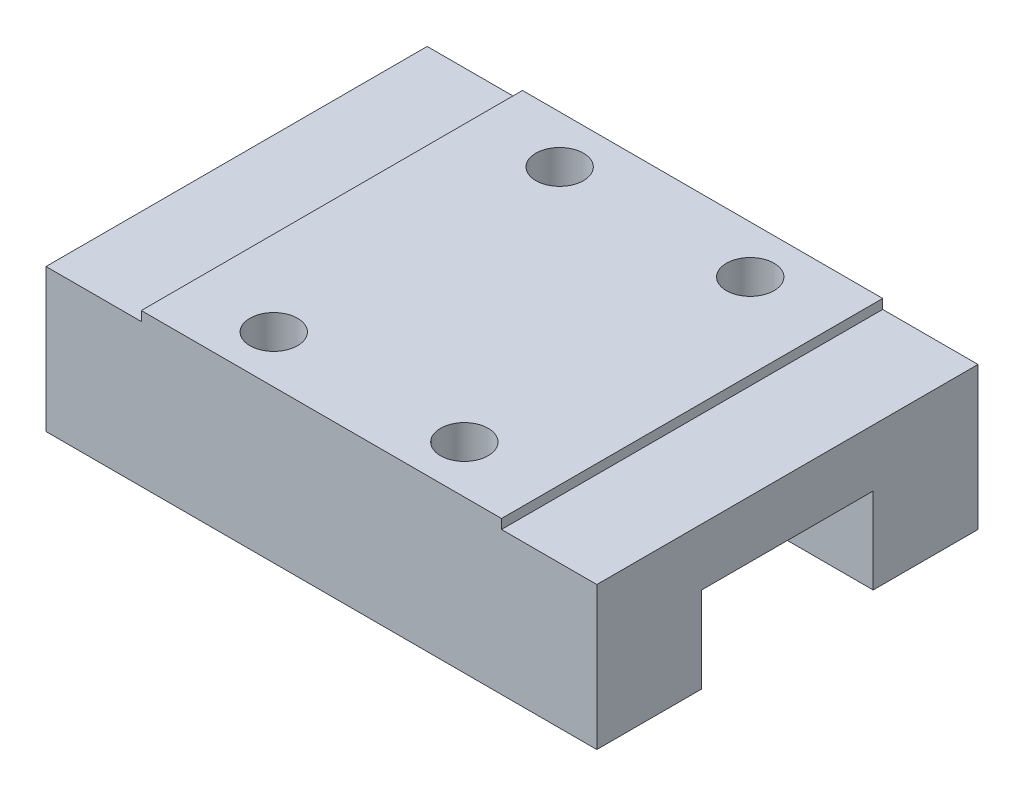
ISO-10303-21;
HEADER;
FILE_DESCRIPTION(('STEP AP214'),'2;1');
FILE_NAME('part.step','',(''),(''),'','','');
FILE_SCHEMA(('AUTOMOTIVE_DESIGN { 1 0 10303 214 1 1 1 1 }'));
ENDSEC;
DATA;
#1=APPLICATION_CONTEXT('core data for automotive mechanical design processes');
#2=APPLICATION_PROTOCOL_DEFINITION('international standard','automotive_design',2000,#1);
#3=PRODUCT_CONTEXT('',#1,'mechanical');
#4=PRODUCT('Part','Part','',(#3));
#5=PRODUCT_RELATED_PRODUCT_CATEGORY('part','',(#4));
#6=PRODUCT_DEFINITION_FORMATION('','',#4);
#7=PRODUCT_DEFINITION_CONTEXT('part definition',#1,'design');
#8=PRODUCT_DEFINITION('design','',#6,#7);
#9=PRODUCT_DEFINITION_SHAPE('','',#8);
#10=(LENGTH_UNIT() NAMED_UNIT(*) SI_UNIT(.MILLI.,.METRE.));
#11=(NAMED_UNIT(*) PLANE_ANGLE_UNIT() SI_UNIT($,.RADIAN.));
#12=(NAMED_UNIT(*) SI_UNIT($,.STERADIAN.) SOLID_ANGLE_UNIT());
#13=UNCERTAINTY_MEASURE_WITH_UNIT(LENGTH_MEASURE(1.E-05),#10,'distance_accuracy_value','');
#14=(GEOMETRIC_REPRESENTATION_CONTEXT(3) GLOBAL_UNCERTAINTY_ASSIGNED_CONTEXT((#13)) GLOBAL_UNIT_ASSIGNED_CONTEXT((#10,
#11,#12)) REPRESENTATION_CONTEXT('',''));
#15=CARTESIAN_POINT('',(0.,0.,0.));
#16=DIRECTION('',(0.,0.,1.));
#17=DIRECTION('',(1.,0.,0.));
#18=AXIS2_PLACEMENT_3D('',#15,#16,#17);
#19=CARTESIAN_POINT('',(0.,0.,20.));
#20=DIRECTION('',(0.,1.,0.));
#21=DIRECTION('',(0.,0.,1.));
#22=AXIS2_PLACEMENT_3D('',#19,#20,#21);
#23=PLANE('',#22);
#24=CARTESIAN_POINT('',(19.4500000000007,0.,17.4999999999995));
#25=DIRECTION('',(0.,1.,0.));
#26=DIRECTION('',(0.,0.,1.));
#27=AXIS2_PLACEMENT_3D('',#24,#25,#26);
#28=CIRCLE('',#27,1.25000000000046);
#29=CARTESIAN_POINT('',(19.4500000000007,0.,18.75));
#30=VERTEX_POINT('',#29);
#31=EDGE_CURVE('E295',#30,#30,#28,.T.);
#32=ORIENTED_EDGE('',*,*,#31,.T.);
#33=EDGE_LOOP('',(#32));
#34=FACE_BOUND('',#33,.T.);
#35=CARTESIAN_POINT('',(9.44999999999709,0.,17.5));
#36=DIRECTION('',(0.,1.,0.));
#37=DIRECTION('',(0.,0.,1.));
#38=AXIS2_PLACEMENT_3D('',#35,#36,#37);
#39=CIRCLE('',#38,1.25);
#40=CARTESIAN_POINT('',(9.44999999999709,0.,18.75));
#41=VERTEX_POINT('',#40);
#42=EDGE_CURVE('E186',#41,#41,#39,.T.);
#43=ORIENTED_EDGE('',*,*,#42,.T.);
#44=EDGE_LOOP('',(#43));
#45=FACE_BOUND('',#44,.T.);
#46=DIRECTION('',(0.,0.,-1.));
#47=VECTOR('',#46,1.);
#48=CARTESIAN_POINT('',(0.,0.,20.));
#49=LINE('',#48,#47);
#50=CARTESIAN_POINT('',(0.,0.,20.));
#51=VERTEX_POINT('',#50);
#52=CARTESIAN_POINT('',(0.,0.,14.5));
#53=VERTEX_POINT('',#52);
#54=EDGE_CURVE('E165',#51,#53,#49,.T.);
#55=ORIENTED_EDGE('',*,*,#54,.T.);
#56=DIRECTION('',(1.,0.,0.));
#57=VECTOR('',#56,1.);
#58=CARTESIAN_POINT('',(0.,0.,14.5));
#59=LINE('',#58,#57);
#60=CARTESIAN_POINT('',(28.9000000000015,0.,14.5));
#61=VERTEX_POINT('',#60);
#62=EDGE_CURVE('E131',#53,#61,#59,.T.);
#63=ORIENTED_EDGE('',*,*,#62,.T.);
#64=DIRECTION('',(0.,0.,-1.));
#65=VECTOR('',#64,1.);
#66=CARTESIAN_POINT('',(28.9000000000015,0.,20.));
#67=LINE('',#66,#65);
#68=CARTESIAN_POINT('',(28.9000000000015,0.,20.));
#69=VERTEX_POINT('',#68);
#70=EDGE_CURVE('E128',#69,#61,#67,.T.);
#71=ORIENTED_EDGE('',*,*,#70,.F.);
#72=DIRECTION('',(1.,0.,0.));
#73=VECTOR('',#72,1.);
#74=CARTESIAN_POINT('',(0.,0.,20.));
#75=LINE('',#74,#73);
#76=EDGE_CURVE('E114',#51,#69,#75,.T.);
#77=ORIENTED_EDGE('',*,*,#76,.F.);
#78=EDGE_LOOP('',(#55,#63,#71,#77));
#79=FACE_BOUND('',#78,.T.);
#80=ADVANCED_FACE('F32',(#34,#45,#79),#23,.F.);
#81=CARTESIAN_POINT('',(23.9000000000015,7.5,20.));
#82=DIRECTION('',(-1.,0.,0.));
#83=DIRECTION('',(0.,0.,1.));
#84=AXIS2_PLACEMENT_3D('',#81,#82,#83);
#85=PLANE('',#84);
#86=DIRECTION('',(0.,1.,0.));
#87=VECTOR('',#86,1.);
#88=CARTESIAN_POINT('',(23.9000000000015,7.5,0.));
#89=LINE('',#88,#87);
#90=CARTESIAN_POINT('',(23.9000000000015,7.5,0.));
#91=VERTEX_POINT('',#90);
#92=CARTESIAN_POINT('',(23.9000000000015,8.,0.));
#93=VERTEX_POINT('',#92);
#94=EDGE_CURVE('E144',#91,#93,#89,.T.);
#95=ORIENTED_EDGE('',*,*,#94,.T.);
#96=DIRECTION('',(0.,0.,-1.));
#97=VECTOR('',#96,1.);
#98=CARTESIAN_POINT('',(23.9000000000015,8.,20.));
#99=LINE('',#98,#97);
#100=CARTESIAN_POINT('',(23.9000000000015,8.,20.));
#101=VERTEX_POINT('',#100);
#102=EDGE_CURVE('E41',#101,#93,#99,.T.);
#103=ORIENTED_EDGE('',*,*,#102,.F.);
#104=DIRECTION('',(0.,1.,0.));
#105=VECTOR('',#104,1.);
#106=CARTESIAN_POINT('',(23.9000000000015,7.5,20.));
#107=LINE('',#106,#105);
#108=CARTESIAN_POINT('',(23.9000000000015,7.5,20.));
#109=VERTEX_POINT('',#108);
#110=EDGE_CURVE('E162',#109,#101,#107,.T.);
#111=ORIENTED_EDGE('',*,*,#110,.F.);
#112=DIRECTION('',(0.,0.,-1.));
#113=VECTOR('',#112,1.);
#114=CARTESIAN_POINT('',(23.9000000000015,7.5,20.));
#115=LINE('',#114,#113);
#116=EDGE_CURVE('E140',#109,#91,#115,.T.);
#117=ORIENTED_EDGE('',*,*,#116,.T.);
#118=EDGE_LOOP('',(#95,#103,#111,#117));
#119=FACE_BOUND('',#118,.T.);
#120=ADVANCED_FACE('F34',(#119),#85,.F.);
#121=CARTESIAN_POINT('',(5.,8.,20.));
#122=DIRECTION('',(0.,-1.,0.));
#123=DIRECTION('',(0.,0.,-1.));
#124=AXIS2_PLACEMENT_3D('',#121,#122,#123);
#125=PLANE('',#124);
#126=CARTESIAN_POINT('',(19.4500000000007,8.,2.49999999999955));
#127=DIRECTION('',(0.,1.,0.));
#128=DIRECTION('',(0.,0.,1.));
#129=AXIS2_PLACEMENT_3D('',#126,#127,#128);
#130=CIRCLE('',#129,1.25000000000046);
#131=CARTESIAN_POINT('',(19.4500000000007,8.,3.75));
#132=VERTEX_POINT('',#131);
#133=EDGE_CURVE('E293',#132,#132,#130,.T.);
#134=ORIENTED_EDGE('',*,*,#133,.F.);
#135=EDGE_LOOP('',(#134));
#136=FACE_BOUND('',#135,.T.);
#137=CARTESIAN_POINT('',(19.4500000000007,8.,17.4999999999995));
#138=DIRECTION('',(0.,1.,0.));
#139=DIRECTION('',(0.,0.,1.));
#140=AXIS2_PLACEMENT_3D('',#137,#138,#139);
#141=CIRCLE('',#140,1.25000000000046);
#142=CARTESIAN_POINT('',(19.4500000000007,8.,18.75));
#143=VERTEX_POINT('',#142);
#144=EDGE_CURVE('E292',#143,#143,#141,.T.);
#145=ORIENTED_EDGE('',*,*,#144,.F.);
#146=EDGE_LOOP('',(#145));
#147=FACE_BOUND('',#146,.T.);
#148=CARTESIAN_POINT('',(9.44999999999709,8.,17.5));
#149=DIRECTION('',(0.,1.,0.));
#150=DIRECTION('',(0.,0.,1.));
#151=AXIS2_PLACEMENT_3D('',#148,#149,#150);
#152=CIRCLE('',#151,1.25);
#153=CARTESIAN_POINT('',(9.44999999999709,8.,18.75));
#154=VERTEX_POINT('',#153);
#155=EDGE_CURVE('E191',#154,#154,#152,.T.);
#156=ORIENTED_EDGE('',*,*,#155,.F.);
#157=EDGE_LOOP('',(#156));
#158=FACE_BOUND('',#157,.T.);
#159=CARTESIAN_POINT('',(9.45000000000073,8.,2.5));
#160=DIRECTION('',(0.,1.,0.));
#161=DIRECTION('',(0.,0.,1.));
#162=AXIS2_PLACEMENT_3D('',#159,#160,#161);
#163=CIRCLE('',#162,1.25);
#164=CARTESIAN_POINT('',(9.45000000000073,8.,3.75));
#165=VERTEX_POINT('',#164);
#166=EDGE_CURVE('E179',#165,#165,#163,.T.);
#167=ORIENTED_EDGE('',*,*,#166,.F.);
#168=EDGE_LOOP('',(#167));
#169=FACE_BOUND('',#168,.T.);
#170=DIRECTION('',(-1.,0.,0.));
#171=VECTOR('',#170,1.);
#172=CARTESIAN_POINT('',(5.,8.,0.));
#173=LINE('',#172,#171);
#174=CARTESIAN_POINT('',(5.,8.,0.));
#175=VERTEX_POINT('',#174);
#176=EDGE_CURVE('E147',#93,#175,#173,.T.);
#177=ORIENTED_EDGE('',*,*,#176,.T.);
#178=DIRECTION('',(0.,0.,-1.));
#179=VECTOR('',#178,1.);
#180=CARTESIAN_POINT('',(5.,8.,20.));
#181=LINE('',#180,#179);
#182=CARTESIAN_POINT('',(5.,8.,20.));
#183=VERTEX_POINT('',#182);
#184=EDGE_CURVE('E173',#183,#175,#181,.T.);
#185=ORIENTED_EDGE('',*,*,#184,.F.);
#186=DIRECTION('',(-1.,0.,0.));
#187=VECTOR('',#186,1.);
#188=CARTESIAN_POINT('',(5.,8.,20.));
#189=LINE('',#188,#187);
#190=EDGE_CURVE('E99',#101,#183,#189,.T.);
#191=ORIENTED_EDGE('',*,*,#190,.F.);
#192=ORIENTED_EDGE('',*,*,#102,.T.);
#193=EDGE_LOOP('',(#177,#185,#191,#192));
#194=FACE_BOUND('',#193,.T.);
#195=ADVANCED_FACE('F262',(#136,#147,#158,#169,#194),#125,.F.);
#196=CARTESIAN_POINT('',(5.,7.5,20.));
#197=DIRECTION('',(1.,0.,0.));
#198=DIRECTION('',(0.,0.,-1.));
#199=AXIS2_PLACEMENT_3D('',#196,#197,#198);
#200=PLANE('',#199);
#201=DIRECTION('',(0.,-1.,0.));
#202=VECTOR('',#201,1.);
#203=CARTESIAN_POINT('',(5.,7.5,0.));
#204=LINE('',#203,#202);
#205=CARTESIAN_POINT('',(5.,7.5,0.));
#206=VERTEX_POINT('',#205);
#207=EDGE_CURVE('E149',#175,#206,#204,.T.);
#208=ORIENTED_EDGE('',*,*,#207,.T.);
#209=DIRECTION('',(0.,0.,-1.));
#210=VECTOR('',#209,1.);
#211=CARTESIAN_POINT('',(5.,7.5,20.));
#212=LINE('',#211,#210);
#213=CARTESIAN_POINT('',(5.,7.5,20.));
#214=VERTEX_POINT('',#213);
#215=EDGE_CURVE('E170',#214,#206,#212,.T.);
#216=ORIENTED_EDGE('',*,*,#215,.F.);
#217=DIRECTION('',(0.,-1.,0.));
#218=VECTOR('',#217,1.);
#219=CARTESIAN_POINT('',(5.,7.5,20.));
#220=LINE('',#219,#218);
#221=EDGE_CURVE('E216',#183,#214,#220,.T.);
#222=ORIENTED_EDGE('',*,*,#221,.F.);
#223=ORIENTED_EDGE('',*,*,#184,.T.);
#224=EDGE_LOOP('',(#208,#216,#222,#223));
#225=FACE_BOUND('',#224,.T.);
#226=ADVANCED_FACE('F264',(#225),#200,.F.);
#227=CARTESIAN_POINT('',(0.,7.5,20.));
#228=DIRECTION('',(0.,-1.,0.));
#229=DIRECTION('',(0.,0.,-1.));
#230=AXIS2_PLACEMENT_3D('',#227,#228,#229);
#231=PLANE('',#230);
#232=DIRECTION('',(-1.,0.,0.));
#233=VECTOR('',#232,1.);
#234=CARTESIAN_POINT('',(0.,7.5,0.));
#235=LINE('',#234,#233);
#236=CARTESIAN_POINT('',(0.,7.5,0.));
#237=VERTEX_POINT('',#236);
#238=EDGE_CURVE('E151',#206,#237,#235,.T.);
#239=ORIENTED_EDGE('',*,*,#238,.T.);
#240=DIRECTION('',(0.,0.,-1.));
#241=VECTOR('',#240,1.);
#242=CARTESIAN_POINT('',(0.,7.5,20.));
#243=LINE('',#242,#241);
#244=CARTESIAN_POINT('',(0.,7.5,20.));
#245=VERTEX_POINT('',#244);
#246=EDGE_CURVE('E167',#245,#237,#243,.T.);
#247=ORIENTED_EDGE('',*,*,#246,.F.);
#248=DIRECTION('',(-1.,0.,0.));
#249=VECTOR('',#248,1.);
#250=CARTESIAN_POINT('',(0.,7.5,20.));
#251=LINE('',#250,#249);
#252=EDGE_CURVE('E218',#214,#245,#251,.T.);
#253=ORIENTED_EDGE('',*,*,#252,.F.);
#254=ORIENTED_EDGE('',*,*,#215,.T.);
#255=EDGE_LOOP('',(#239,#247,#253,#254));
#256=FACE_BOUND('',#255,.T.);
#257=ADVANCED_FACE('F224',(#256),#231,.F.);
#258=CARTESIAN_POINT('',(0.,0.,20.));
#259=DIRECTION('',(1.,0.,0.));
#260=DIRECTION('',(0.,0.,-1.));
#261=AXIS2_PLACEMENT_3D('',#258,#259,#260);
#262=PLANE('',#261);
#263=DIRECTION('',(0.,0.,1.));
#264=VECTOR('',#263,1.);
#265=CARTESIAN_POINT('',(0.,4.5,14.5));
#266=LINE('',#265,#264);
#267=CARTESIAN_POINT('',(0.,4.5,5.5));
#268=VERTEX_POINT('',#267);
#269=CARTESIAN_POINT('',(0.,4.5,14.5));
#270=VERTEX_POINT('',#269);
#271=EDGE_CURVE('E198',#268,#270,#266,.T.);
#272=ORIENTED_EDGE('',*,*,#271,.T.);
#273=DIRECTION('',(0.,-1.,0.));
#274=VECTOR('',#273,1.);
#275=CARTESIAN_POINT('',(0.,-2.,14.5));
#276=LINE('',#275,#274);
#277=EDGE_CURVE('E201',#270,#53,#276,.T.);
#278=ORIENTED_EDGE('',*,*,#277,.T.);
#279=ORIENTED_EDGE('',*,*,#54,.F.);
#280=DIRECTION('',(0.,-1.,0.));
#281=VECTOR('',#280,1.);
#282=CARTESIAN_POINT('',(0.,0.,20.));
#283=LINE('',#282,#281);
#284=EDGE_CURVE('E121',#245,#51,#283,.T.);
#285=ORIENTED_EDGE('',*,*,#284,.F.);
#286=ORIENTED_EDGE('',*,*,#246,.T.);
#287=DIRECTION('',(0.,-1.,0.));
#288=VECTOR('',#287,1.);
#289=CARTESIAN_POINT('',(0.,0.,0.));
#290=LINE('',#289,#288);
#291=CARTESIAN_POINT('',(0.,0.,0.));
#292=VERTEX_POINT('',#291);
#293=EDGE_CURVE('E153',#237,#292,#290,.T.);
#294=ORIENTED_EDGE('',*,*,#293,.T.);
#295=CARTESIAN_POINT('',(0.,0.,5.5));
#296=VERTEX_POINT('',#295);
#297=EDGE_CURVE('E134',#296,#292,#49,.T.);
#298=ORIENTED_EDGE('',*,*,#297,.F.);
#299=DIRECTION('',(0.,1.,0.));
#300=VECTOR('',#299,1.);
#301=CARTESIAN_POINT('',(0.,-2.,5.5));
#302=LINE('',#301,#300);
#303=EDGE_CURVE('E195',#296,#268,#302,.T.);
#304=ORIENTED_EDGE('',*,*,#303,.T.);
#305=EDGE_LOOP('',(#272,#278,#279,#285,#286,#294,#298,#304));
#306=FACE_BOUND('',#305,.T.);
#307=ADVANCED_FACE('F228',(#306),#262,.F.);
#308=CARTESIAN_POINT('',(19.4500000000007,0.,2.49999999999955));
#309=DIRECTION('',(0.,1.,0.));
#310=DIRECTION('',(0.,0.,1.));
#311=AXIS2_PLACEMENT_3D('',#308,#309,#310);
#312=CIRCLE('',#311,1.25000000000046);
#313=CARTESIAN_POINT('',(19.4500000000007,0.,3.75));
#314=VERTEX_POINT('',#313);
#315=EDGE_CURVE('E36',#314,#314,#312,.T.);
#316=ORIENTED_EDGE('',*,*,#315,.T.);
#317=EDGE_LOOP('',(#316));
#318=FACE_BOUND('',#317,.T.);
#319=CARTESIAN_POINT('',(9.45000000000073,0.,2.5));
#320=DIRECTION('',(0.,1.,0.));
#321=DIRECTION('',(0.,0.,1.));
#322=AXIS2_PLACEMENT_3D('',#319,#320,#321);
#323=CIRCLE('',#322,1.25);
#324=CARTESIAN_POINT('',(9.45000000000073,0.,3.75));
#325=VERTEX_POINT('',#324);
#326=EDGE_CURVE('E176',#325,#325,#323,.T.);
#327=ORIENTED_EDGE('',*,*,#326,.T.);
#328=EDGE_LOOP('',(#327));
#329=FACE_BOUND('',#328,.T.);
#330=CARTESIAN_POINT('',(28.9000000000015,0.,5.5));
#331=VERTEX_POINT('',#330);
#332=CARTESIAN_POINT('',(28.9000000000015,0.,0.));
#333=VERTEX_POINT('',#332);
#334=EDGE_CURVE('E135',#331,#333,#67,.T.);
#335=ORIENTED_EDGE('',*,*,#334,.F.);
#336=DIRECTION('',(-1.,0.,0.));
#337=VECTOR('',#336,1.);
#338=CARTESIAN_POINT('',(0.,0.,5.5));
#339=LINE('',#338,#337);
#340=EDGE_CURVE('E49',#331,#296,#339,.T.);
#341=ORIENTED_EDGE('',*,*,#340,.T.);
#342=ORIENTED_EDGE('',*,*,#297,.T.);
#343=DIRECTION('',(1.,0.,0.));
#344=VECTOR('',#343,1.);
#345=CARTESIAN_POINT('',(0.,0.,0.));
#346=LINE('',#345,#344);
#347=EDGE_CURVE('E156',#292,#333,#346,.T.);
#348=ORIENTED_EDGE('',*,*,#347,.T.);
#349=EDGE_LOOP('',(#335,#341,#342,#348));
#350=FACE_BOUND('',#349,.T.);
#351=ADVANCED_FACE('F252',(#318,#329,#350),#23,.F.);
#352=CARTESIAN_POINT('',(28.9000000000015,0.,20.));
#353=DIRECTION('',(-1.,0.,0.));
#354=DIRECTION('',(0.,0.,1.));
#355=AXIS2_PLACEMENT_3D('',#352,#353,#354);
#356=PLANE('',#355);
#357=ORIENTED_EDGE('',*,*,#70,.T.);
#358=DIRECTION('',(0.,-1.,0.));
#359=VECTOR('',#358,1.);
#360=CARTESIAN_POINT('',(28.9000000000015,-2.,14.5));
#361=LINE('',#360,#359);
#362=CARTESIAN_POINT('',(28.9000000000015,4.5,14.5));
#363=VERTEX_POINT('',#362);
#364=EDGE_CURVE('E183',#363,#61,#361,.T.);
#365=ORIENTED_EDGE('',*,*,#364,.F.);
#366=DIRECTION('',(0.,0.,1.));
#367=VECTOR('',#366,1.);
#368=CARTESIAN_POINT('',(28.9000000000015,4.5,14.5));
#369=LINE('',#368,#367);
#370=CARTESIAN_POINT('',(28.9000000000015,4.5,5.5));
#371=VERTEX_POINT('',#370);
#372=EDGE_CURVE('E178',#371,#363,#369,.T.);
#373=ORIENTED_EDGE('',*,*,#372,.F.);
#374=DIRECTION('',(0.,-1.,0.));
#375=VECTOR('',#374,1.);
#376=CARTESIAN_POINT('',(28.9000000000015,0.,5.5));
#377=LINE('',#376,#375);
#378=EDGE_CURVE('E11',#371,#331,#377,.T.);
#379=ORIENTED_EDGE('',*,*,#378,.T.);
#380=ORIENTED_EDGE('',*,*,#334,.T.);
#381=DIRECTION('',(0.,1.,0.));
#382=VECTOR('',#381,1.);
#383=CARTESIAN_POINT('',(28.9000000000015,0.,0.));
#384=LINE('',#383,#382);
#385=CARTESIAN_POINT('',(28.9000000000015,7.5,0.));
#386=VERTEX_POINT('',#385);
#387=EDGE_CURVE('E159',#333,#386,#384,.T.);
#388=ORIENTED_EDGE('',*,*,#387,.T.);
#389=DIRECTION('',(0.,0.,-1.));
#390=VECTOR('',#389,1.);
#391=CARTESIAN_POINT('',(28.9000000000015,7.5,20.));
#392=LINE('',#391,#390);
#393=CARTESIAN_POINT('',(28.9000000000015,7.5,20.));
#394=VERTEX_POINT('',#393);
#395=EDGE_CURVE('E138',#394,#386,#392,.T.);
#396=ORIENTED_EDGE('',*,*,#395,.F.);
#397=DIRECTION('',(0.,1.,0.));
#398=VECTOR('',#397,1.);
#399=CARTESIAN_POINT('',(28.9000000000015,0.,20.));
#400=LINE('',#399,#398);
#401=EDGE_CURVE('E118',#69,#394,#400,.T.);
#402=ORIENTED_EDGE('',*,*,#401,.F.);
#403=EDGE_LOOP('',(#357,#365,#373,#379,#380,#388,#396,#402));
#404=FACE_BOUND('',#403,.T.);
#405=ADVANCED_FACE('F137',(#404),#356,.F.);
#406=CARTESIAN_POINT('',(23.9000000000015,7.5,20.));
#407=DIRECTION('',(0.,-1.,0.));
#408=DIRECTION('',(0.,0.,-1.));
#409=AXIS2_PLACEMENT_3D('',#406,#407,#408);
#410=PLANE('',#409);
#411=DIRECTION('',(-1.,0.,0.));
#412=VECTOR('',#411,1.);
#413=CARTESIAN_POINT('',(23.9000000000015,7.5,0.));
#414=LINE('',#413,#412);
#415=EDGE_CURVE('E90',#386,#91,#414,.T.);
#416=ORIENTED_EDGE('',*,*,#415,.T.);
#417=ORIENTED_EDGE('',*,*,#116,.F.);
#418=DIRECTION('',(-1.,0.,0.));
#419=VECTOR('',#418,1.);
#420=CARTESIAN_POINT('',(23.9000000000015,7.5,20.));
#421=LINE('',#420,#419);
#422=EDGE_CURVE('E57',#394,#109,#421,.T.);
#423=ORIENTED_EDGE('',*,*,#422,.F.);
#424=ORIENTED_EDGE('',*,*,#395,.T.);
#425=EDGE_LOOP('',(#416,#417,#423,#424));
#426=FACE_BOUND('',#425,.T.);
#427=ADVANCED_FACE('F255',(#426),#410,.F.);
#428=CARTESIAN_POINT('',(23.9000000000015,8.,20.));
#429=DIRECTION('',(0.,0.,-1.));
#430=DIRECTION('',(-1.,0.,0.));
#431=AXIS2_PLACEMENT_3D('',#428,#429,#430);
#432=PLANE('',#431);
#433=ORIENTED_EDGE('',*,*,#110,.T.);
#434=ORIENTED_EDGE('',*,*,#190,.T.);
#435=ORIENTED_EDGE('',*,*,#221,.T.);
#436=ORIENTED_EDGE('',*,*,#252,.T.);
#437=ORIENTED_EDGE('',*,*,#284,.T.);
#438=ORIENTED_EDGE('',*,*,#76,.T.);
#439=ORIENTED_EDGE('',*,*,#401,.T.);
#440=ORIENTED_EDGE('',*,*,#422,.T.);
#441=EDGE_LOOP('',(#433,#434,#435,#436,#437,#438,#439,#440));
#442=FACE_BOUND('',#441,.T.);
#443=ADVANCED_FACE('F116',(#442),#432,.F.);
#444=CARTESIAN_POINT('',(23.9000000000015,8.,0.));
#445=DIRECTION('',(0.,0.,-1.));
#446=DIRECTION('',(-1.,0.,0.));
#447=AXIS2_PLACEMENT_3D('',#444,#445,#446);
#448=PLANE('',#447);
#449=ORIENTED_EDGE('',*,*,#94,.F.);
#450=ORIENTED_EDGE('',*,*,#415,.F.);
#451=ORIENTED_EDGE('',*,*,#387,.F.);
#452=ORIENTED_EDGE('',*,*,#347,.F.);
#453=ORIENTED_EDGE('',*,*,#293,.F.);
#454=ORIENTED_EDGE('',*,*,#238,.F.);
#455=ORIENTED_EDGE('',*,*,#207,.F.);
#456=ORIENTED_EDGE('',*,*,#176,.F.);
#457=EDGE_LOOP('',(#449,#450,#451,#452,#453,#454,#455,#456));
#458=FACE_BOUND('',#457,.T.);
#459=ADVANCED_FACE('F257',(#458),#448,.T.);
#460=CARTESIAN_POINT('',(0.,-2.,14.5));
#461=DIRECTION('',(0.,0.,1.));
#462=DIRECTION('',(1.,0.,0.));
#463=AXIS2_PLACEMENT_3D('',#460,#461,#462);
#464=PLANE('',#463);
#465=ORIENTED_EDGE('',*,*,#277,.F.);
#466=DIRECTION('',(1.,0.,0.));
#467=VECTOR('',#466,1.);
#468=CARTESIAN_POINT('',(0.,4.5,14.5));
#469=LINE('',#468,#467);
#470=EDGE_CURVE('E207',#270,#363,#469,.T.);
#471=ORIENTED_EDGE('',*,*,#470,.T.);
#472=ORIENTED_EDGE('',*,*,#364,.T.);
#473=ORIENTED_EDGE('',*,*,#62,.F.);
#474=EDGE_LOOP('',(#465,#471,#472,#473));
#475=FACE_BOUND('',#474,.T.);
#476=ADVANCED_FACE('F324',(#475),#464,.F.);
#477=CARTESIAN_POINT('',(0.,-2.,5.5));
#478=DIRECTION('',(0.,0.,-1.));
#479=DIRECTION('',(-1.,0.,0.));
#480=AXIS2_PLACEMENT_3D('',#477,#478,#479);
#481=PLANE('',#480);
#482=ORIENTED_EDGE('',*,*,#378,.F.);
#483=DIRECTION('',(1.,0.,0.));
#484=VECTOR('',#483,1.);
#485=CARTESIAN_POINT('',(0.,4.5,5.5));
#486=LINE('',#485,#484);
#487=EDGE_CURVE('E203',#268,#371,#486,.T.);
#488=ORIENTED_EDGE('',*,*,#487,.F.);
#489=ORIENTED_EDGE('',*,*,#303,.F.);
#490=ORIENTED_EDGE('',*,*,#340,.F.);
#491=EDGE_LOOP('',(#482,#488,#489,#490));
#492=FACE_BOUND('',#491,.T.);
#493=ADVANCED_FACE('F244',(#492),#481,.F.);
#494=CARTESIAN_POINT('',(0.,4.5,14.5));
#495=DIRECTION('',(0.,1.,0.));
#496=DIRECTION('',(0.,0.,1.));
#497=AXIS2_PLACEMENT_3D('',#494,#495,#496);
#498=PLANE('',#497);
#499=ORIENTED_EDGE('',*,*,#372,.T.);
#500=ORIENTED_EDGE('',*,*,#470,.F.);
#501=ORIENTED_EDGE('',*,*,#271,.F.);
#502=ORIENTED_EDGE('',*,*,#487,.T.);
#503=EDGE_LOOP('',(#499,#500,#501,#502));
#504=FACE_BOUND('',#503,.T.);
#505=ADVANCED_FACE('F247',(#504),#498,.F.);
#506=CARTESIAN_POINT('',(9.45000000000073,-2.,2.5));
#507=DIRECTION('',(0.,1.,0.));
#508=DIRECTION('',(0.,0.,1.));
#509=AXIS2_PLACEMENT_3D('',#506,#507,#508);
#510=CYLINDRICAL_SURFACE('',#509,1.25);
#511=ORIENTED_EDGE('',*,*,#166,.T.);
#512=EDGE_LOOP('',(#511));
#513=FACE_BOUND('',#512,.T.);
#514=ORIENTED_EDGE('',*,*,#326,.F.);
#515=EDGE_LOOP('',(#514));
#516=FACE_BOUND('',#515,.T.);
#517=ADVANCED_FACE('F311',(#513,#516),#510,.F.);
#518=CARTESIAN_POINT('',(9.44999999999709,-2.,17.5));
#519=DIRECTION('',(0.,1.,0.));
#520=DIRECTION('',(0.,0.,1.));
#521=AXIS2_PLACEMENT_3D('',#518,#519,#520);
#522=CYLINDRICAL_SURFACE('',#521,1.25);
#523=ORIENTED_EDGE('',*,*,#155,.T.);
#524=EDGE_LOOP('',(#523));
#525=FACE_BOUND('',#524,.T.);
#526=ORIENTED_EDGE('',*,*,#42,.F.);
#527=EDGE_LOOP('',(#526));
#528=FACE_BOUND('',#527,.T.);
#529=ADVANCED_FACE('F305',(#525,#528),#522,.F.);
#530=CARTESIAN_POINT('',(19.4500000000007,-2.,17.4999999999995));
#531=DIRECTION('',(0.,1.,0.));
#532=DIRECTION('',(0.,0.,1.));
#533=AXIS2_PLACEMENT_3D('',#530,#531,#532);
#534=CYLINDRICAL_SURFACE('',#533,1.25000000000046);
#535=ORIENTED_EDGE('',*,*,#144,.T.);
#536=EDGE_LOOP('',(#535));
#537=FACE_BOUND('',#536,.T.);
#538=ORIENTED_EDGE('',*,*,#31,.F.);
#539=EDGE_LOOP('',(#538));
#540=FACE_BOUND('',#539,.T.);
#541=ADVANCED_FACE('F310',(#537,#540),#534,.F.);
#542=CARTESIAN_POINT('',(19.4500000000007,-2.,2.49999999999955));
#543=DIRECTION('',(0.,1.,0.));
#544=DIRECTION('',(0.,0.,1.));
#545=AXIS2_PLACEMENT_3D('',#542,#543,#544);
#546=CYLINDRICAL_SURFACE('',#545,1.25000000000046);
#547=ORIENTED_EDGE('',*,*,#133,.T.);
#548=EDGE_LOOP('',(#547));
#549=FACE_BOUND('',#548,.T.);
#550=ORIENTED_EDGE('',*,*,#315,.F.);
#551=EDGE_LOOP('',(#550));
#552=FACE_BOUND('',#551,.T.);
#553=ADVANCED_FACE('F318',(#549,#552),#546,.F.);
#554=CLOSED_SHELL('',(#80,#120,#195,#226,#257,#307,#351,#405,#427,#443,#459,#476,#493,#505,#517,
#529,#541,#553));
#555=MANIFOLD_SOLID_BREP('B2',#554);
#556=ADVANCED_BREP_SHAPE_REPRESENTATION('',(#18,#555),#14);
#557=SHAPE_DEFINITION_REPRESENTATION(#9,#556);
ENDSEC;
END-ISO-10303-21;
